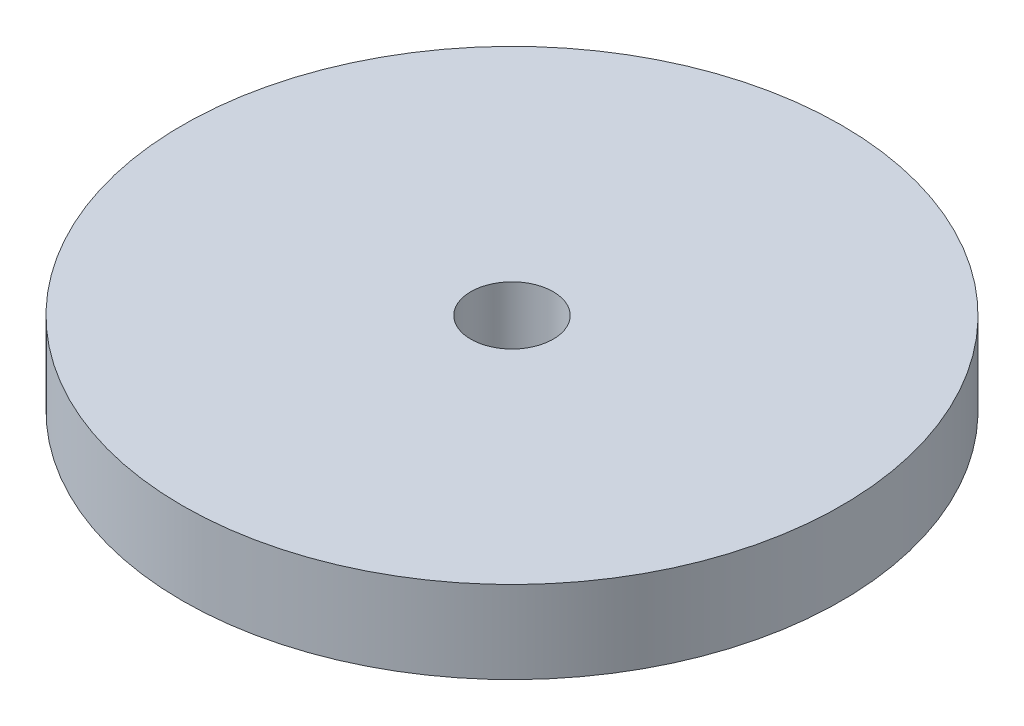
from build123d import *

# Parameters (mm, degrees)
SKETCH1_W = 22.225
SKETCH1_H = 6.35


with BuildPart() as part:
    # Sketch1 → Revolve1 (revolve)
    with BuildSketch(Plane.XY, mode=Mode.PRIVATE) as revolve1_sk:
        with Locations((14.2875, 3.175)):
            Rectangle(SKETCH1_W, SKETCH1_H)
    revolve(revolve1_sk.sketch.rotate(Axis((0, 0, 0), (0, 1, 0)), 90), axis=Axis((0, 0, 0), (0, 1, 0)))


solid = part.part
